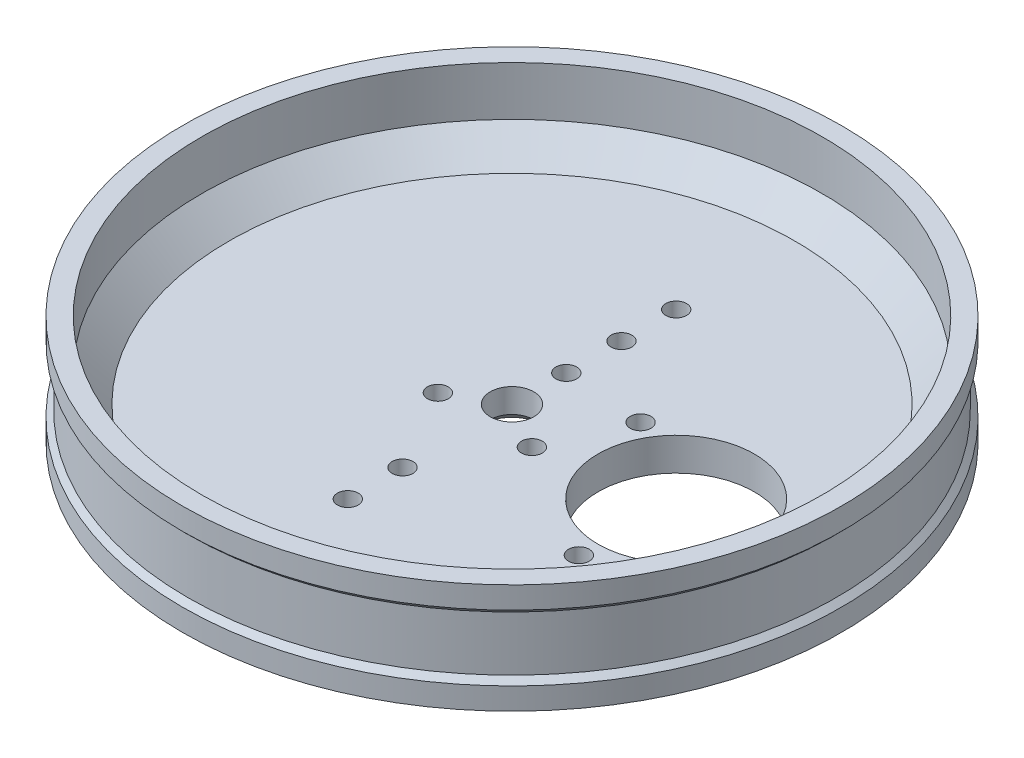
ISO-10303-21;
HEADER;
FILE_DESCRIPTION(('STEP AP214'),'2;1');
FILE_NAME('part.step','',(''),(''),'','','');
FILE_SCHEMA(('AUTOMOTIVE_DESIGN { 1 0 10303 214 1 1 1 1 }'));
ENDSEC;
DATA;
#1=APPLICATION_CONTEXT('core data for automotive mechanical design processes');
#2=APPLICATION_PROTOCOL_DEFINITION('international standard','automotive_design',2000,#1);
#3=PRODUCT_CONTEXT('',#1,'mechanical');
#4=PRODUCT('Part','Part','',(#3));
#5=PRODUCT_RELATED_PRODUCT_CATEGORY('part','',(#4));
#6=PRODUCT_DEFINITION_FORMATION('','',#4);
#7=PRODUCT_DEFINITION_CONTEXT('part definition',#1,'design');
#8=PRODUCT_DEFINITION('design','',#6,#7);
#9=PRODUCT_DEFINITION_SHAPE('','',#8);
#10=(LENGTH_UNIT() NAMED_UNIT(*) SI_UNIT(.MILLI.,.METRE.));
#11=(NAMED_UNIT(*) PLANE_ANGLE_UNIT() SI_UNIT($,.RADIAN.));
#12=(NAMED_UNIT(*) SI_UNIT($,.STERADIAN.) SOLID_ANGLE_UNIT());
#13=UNCERTAINTY_MEASURE_WITH_UNIT(LENGTH_MEASURE(1.E-05),#10,'distance_accuracy_value','');
#14=(GEOMETRIC_REPRESENTATION_CONTEXT(3) GLOBAL_UNCERTAINTY_ASSIGNED_CONTEXT((#13)) GLOBAL_UNIT_ASSIGNED_CONTEXT((#10,
#11,#12)) REPRESENTATION_CONTEXT('',''));
#15=CARTESIAN_POINT('',(0.,0.,0.));
#16=DIRECTION('',(0.,0.,1.));
#17=DIRECTION('',(1.,0.,0.));
#18=AXIS2_PLACEMENT_3D('',#15,#16,#17);
#19=CARTESIAN_POINT('',(0.,20.,0.));
#20=DIRECTION('',(0.,-1.,0.));
#21=DIRECTION('',(0.,0.,-1.));
#22=AXIS2_PLACEMENT_3D('',#19,#20,#21);
#23=CYLINDRICAL_SURFACE('',#22,60.225);
#24=CARTESIAN_POINT('',(0.,16.,0.));
#25=DIRECTION('',(0.,1.,0.));
#26=DIRECTION('',(0.,0.,1.));
#27=AXIS2_PLACEMENT_3D('',#24,#25,#26);
#28=CIRCLE('',#27,60.225);
#29=CARTESIAN_POINT('',(0.,16.,60.225));
#30=VERTEX_POINT('',#29);
#31=EDGE_CURVE('E82',#30,#30,#28,.T.);
#32=ORIENTED_EDGE('',*,*,#31,.T.);
#33=EDGE_LOOP('',(#32));
#34=FACE_BOUND('',#33,.T.);
#35=CARTESIAN_POINT('',(0.,20.,0.));
#36=DIRECTION('',(0.,1.,0.));
#37=DIRECTION('',(0.,0.,1.));
#38=AXIS2_PLACEMENT_3D('',#35,#36,#37);
#39=CIRCLE('',#38,60.225);
#40=CARTESIAN_POINT('',(0.,20.,60.225));
#41=VERTEX_POINT('',#40);
#42=EDGE_CURVE('E52',#41,#41,#39,.T.);
#43=ORIENTED_EDGE('',*,*,#42,.F.);
#44=EDGE_LOOP('',(#43));
#45=FACE_BOUND('',#44,.T.);
#46=ADVANCED_FACE('F32',(#34,#45),#23,.T.);
#47=CARTESIAN_POINT('',(0.,20.,0.));
#48=DIRECTION('',(0.,-1.,0.));
#49=DIRECTION('',(0.,0.,-1.));
#50=AXIS2_PLACEMENT_3D('',#47,#48,#49);
#51=CYLINDRICAL_SURFACE('',#50,3.96875);
#52=CARTESIAN_POINT('',(0.,1.58750000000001,0.));
#53=DIRECTION('',(0.,1.,0.));
#54=DIRECTION('',(0.,0.,1.));
#55=AXIS2_PLACEMENT_3D('',#52,#53,#54);
#56=CIRCLE('',#55,3.96875);
#57=CARTESIAN_POINT('',(0.,1.58750000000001,3.96875));
#58=VERTEX_POINT('',#57);
#59=EDGE_CURVE('E10',#58,#58,#56,.F.);
#60=ORIENTED_EDGE('',*,*,#59,.T.);
#61=EDGE_LOOP('',(#60));
#62=FACE_BOUND('',#61,.T.);
#63=CARTESIAN_POINT('',(0.,6.,0.));
#64=DIRECTION('',(0.,1.,0.));
#65=DIRECTION('',(0.,0.,1.));
#66=AXIS2_PLACEMENT_3D('',#63,#64,#65);
#67=CIRCLE('',#66,3.96875);
#68=CARTESIAN_POINT('',(0.,6.,3.96875));
#69=VERTEX_POINT('',#68);
#70=EDGE_CURVE('E53',#69,#69,#67,.T.);
#71=ORIENTED_EDGE('',*,*,#70,.T.);
#72=EDGE_LOOP('',(#71));
#73=FACE_BOUND('',#72,.T.);
#74=ADVANCED_FACE('F175',(#62,#73),#51,.F.);
#75=CARTESIAN_POINT('',(0.,20.,0.));
#76=DIRECTION('',(0.,1.,0.));
#77=DIRECTION('',(0.,0.,1.));
#78=AXIS2_PLACEMENT_3D('',#75,#76,#77);
#79=PLANE('',#78);
#80=CARTESIAN_POINT('',(0.,20.,0.));
#81=DIRECTION('',(0.,1.,0.));
#82=DIRECTION('',(0.,0.,1.));
#83=AXIS2_PLACEMENT_3D('',#80,#81,#82);
#84=CIRCLE('',#83,56.7);
#85=CARTESIAN_POINT('',(0.,20.,56.7));
#86=VERTEX_POINT('',#85);
#87=EDGE_CURVE('E57',#86,#86,#84,.T.);
#88=ORIENTED_EDGE('',*,*,#87,.F.);
#89=EDGE_LOOP('',(#88));
#90=FACE_BOUND('',#89,.T.);
#91=ORIENTED_EDGE('',*,*,#42,.T.);
#92=EDGE_LOOP('',(#91));
#93=FACE_BOUND('',#92,.T.);
#94=ADVANCED_FACE('F177',(#90,#93),#79,.T.);
#95=CARTESIAN_POINT('',(0.,0.,0.));
#96=DIRECTION('',(0.,1.,0.));
#97=DIRECTION('',(0.,0.,1.));
#98=AXIS2_PLACEMENT_3D('',#95,#96,#97);
#99=PLANE('',#98);
#100=CARTESIAN_POINT('',(14.6020683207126,0.,-8.88999999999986));
#101=DIRECTION('',(0.,1.,0.));
#102=DIRECTION('',(0.,0.,1.));
#103=AXIS2_PLACEMENT_3D('',#100,#101,#102);
#104=CIRCLE('',#103,1.89865);
#105=CARTESIAN_POINT('',(14.6020683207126,0.,-6.99134999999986));
#106=VERTEX_POINT('',#105);
#107=EDGE_CURVE('E136',#106,#106,#104,.T.);
#108=ORIENTED_EDGE('',*,*,#107,.T.);
#109=EDGE_LOOP('',(#108));
#110=FACE_BOUND('',#109,.T.);
#111=CARTESIAN_POINT('',(45.3979316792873,0.,-8.89000000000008));
#112=DIRECTION('',(0.,1.,0.));
#113=DIRECTION('',(0.,0.,1.));
#114=AXIS2_PLACEMENT_3D('',#111,#112,#113);
#115=CIRCLE('',#114,1.89864999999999);
#116=CARTESIAN_POINT('',(45.3979316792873,0.,-6.99135000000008));
#117=VERTEX_POINT('',#116);
#118=EDGE_CURVE('E130',#117,#117,#115,.T.);
#119=ORIENTED_EDGE('',*,*,#118,.T.);
#120=EDGE_LOOP('',(#119));
#121=FACE_BOUND('',#120,.T.);
#122=CARTESIAN_POINT('',(30.,0.,17.78));
#123=DIRECTION('',(0.,1.,0.));
#124=DIRECTION('',(0.,0.,1.));
#125=AXIS2_PLACEMENT_3D('',#122,#123,#124);
#126=CIRCLE('',#125,1.89865);
#127=CARTESIAN_POINT('',(30.,0.,19.67865));
#128=VERTEX_POINT('',#127);
#129=EDGE_CURVE('E124',#128,#128,#126,.T.);
#130=ORIENTED_EDGE('',*,*,#129,.T.);
#131=EDGE_LOOP('',(#130));
#132=FACE_BOUND('',#131,.T.);
#133=CARTESIAN_POINT('',(0.,0.,-30.));
#134=DIRECTION('',(0.,1.,0.));
#135=DIRECTION('',(0.,0.,1.));
#136=AXIS2_PLACEMENT_3D('',#133,#134,#135);
#137=CIRCLE('',#136,1.89865);
#138=CARTESIAN_POINT('',(0.,0.,-28.10135));
#139=VERTEX_POINT('',#138);
#140=EDGE_CURVE('E118',#139,#139,#137,.T.);
#141=ORIENTED_EDGE('',*,*,#140,.T.);
#142=EDGE_LOOP('',(#141));
#143=FACE_BOUND('',#142,.T.);
#144=CARTESIAN_POINT('',(0.,0.,-20.));
#145=DIRECTION('',(0.,1.,0.));
#146=DIRECTION('',(0.,0.,1.));
#147=AXIS2_PLACEMENT_3D('',#144,#145,#146);
#148=CIRCLE('',#147,1.89865);
#149=CARTESIAN_POINT('',(0.,0.,-18.10135));
#150=VERTEX_POINT('',#149);
#151=EDGE_CURVE('E112',#150,#150,#148,.T.);
#152=ORIENTED_EDGE('',*,*,#151,.T.);
#153=EDGE_LOOP('',(#152));
#154=FACE_BOUND('',#153,.T.);
#155=CARTESIAN_POINT('',(0.,0.,30.));
#156=DIRECTION('',(0.,1.,0.));
#157=DIRECTION('',(0.,0.,1.));
#158=AXIS2_PLACEMENT_3D('',#155,#156,#157);
#159=CIRCLE('',#158,1.89865);
#160=CARTESIAN_POINT('',(0.,0.,31.89865));
#161=VERTEX_POINT('',#160);
#162=EDGE_CURVE('E106',#161,#161,#159,.T.);
#163=ORIENTED_EDGE('',*,*,#162,.T.);
#164=EDGE_LOOP('',(#163));
#165=FACE_BOUND('',#164,.T.);
#166=CARTESIAN_POINT('',(0.,0.,20.));
#167=DIRECTION('',(0.,1.,0.));
#168=DIRECTION('',(0.,0.,1.));
#169=AXIS2_PLACEMENT_3D('',#166,#167,#168);
#170=CIRCLE('',#169,1.89865);
#171=CARTESIAN_POINT('',(0.,0.,21.89865));
#172=VERTEX_POINT('',#171);
#173=EDGE_CURVE('E100',#172,#172,#170,.T.);
#174=ORIENTED_EDGE('',*,*,#173,.T.);
#175=EDGE_LOOP('',(#174));
#176=FACE_BOUND('',#175,.T.);
#177=CARTESIAN_POINT('',(30.,0.,0.));
#178=DIRECTION('',(0.,1.,0.));
#179=DIRECTION('',(0.,0.,1.));
#180=AXIS2_PLACEMENT_3D('',#177,#178,#179);
#181=CIRCLE('',#180,14.2875);
#182=CARTESIAN_POINT('',(30.,0.,14.2875));
#183=VERTEX_POINT('',#182);
#184=EDGE_CURVE('E94',#183,#183,#181,.T.);
#185=ORIENTED_EDGE('',*,*,#184,.T.);
#186=EDGE_LOOP('',(#185));
#187=FACE_BOUND('',#186,.T.);
#188=CARTESIAN_POINT('',(0.,0.,0.));
#189=DIRECTION('',(0.,1.,0.));
#190=DIRECTION('',(0.,0.,1.));
#191=AXIS2_PLACEMENT_3D('',#188,#189,#190);
#192=CIRCLE('',#191,5.55625);
#193=CARTESIAN_POINT('',(0.,0.,5.55625));
#194=VERTEX_POINT('',#193);
#195=EDGE_CURVE('E39',#194,#194,#192,.T.);
#196=ORIENTED_EDGE('',*,*,#195,.T.);
#197=EDGE_LOOP('',(#196));
#198=FACE_BOUND('',#197,.T.);
#199=CARTESIAN_POINT('',(8.59259580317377,0.,4.96093749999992));
#200=DIRECTION('',(0.,1.,0.));
#201=DIRECTION('',(0.,0.,1.));
#202=AXIS2_PLACEMENT_3D('',#199,#200,#201);
#203=CIRCLE('',#202,1.89865);
#204=CARTESIAN_POINT('',(8.59259580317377,0.,6.85958749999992));
#205=VERTEX_POINT('',#204);
#206=EDGE_CURVE('E76',#205,#205,#203,.T.);
#207=ORIENTED_EDGE('',*,*,#206,.T.);
#208=EDGE_LOOP('',(#207));
#209=FACE_BOUND('',#208,.T.);
#210=CARTESIAN_POINT('',(-8.59259580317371,0.,4.96093750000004));
#211=DIRECTION('',(0.,1.,0.));
#212=DIRECTION('',(0.,0.,1.));
#213=AXIS2_PLACEMENT_3D('',#210,#211,#212);
#214=CIRCLE('',#213,1.89865);
#215=CARTESIAN_POINT('',(-8.59259580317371,0.,6.85958750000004));
#216=VERTEX_POINT('',#215);
#217=EDGE_CURVE('E70',#216,#216,#214,.T.);
#218=ORIENTED_EDGE('',*,*,#217,.T.);
#219=EDGE_LOOP('',(#218));
#220=FACE_BOUND('',#219,.T.);
#221=CARTESIAN_POINT('',(0.,0.,-9.921875));
#222=DIRECTION('',(0.,1.,0.));
#223=DIRECTION('',(0.,0.,1.));
#224=AXIS2_PLACEMENT_3D('',#221,#222,#223);
#225=CIRCLE('',#224,1.89865);
#226=CARTESIAN_POINT('',(0.,0.,-8.023225));
#227=VERTEX_POINT('',#226);
#228=EDGE_CURVE('E64',#227,#227,#225,.T.);
#229=ORIENTED_EDGE('',*,*,#228,.T.);
#230=EDGE_LOOP('',(#229));
#231=FACE_BOUND('',#230,.T.);
#232=CARTESIAN_POINT('',(0.,0.,0.));
#233=DIRECTION('',(0.,1.,0.));
#234=DIRECTION('',(0.,0.,1.));
#235=AXIS2_PLACEMENT_3D('',#232,#233,#234);
#236=CIRCLE('',#235,60.225);
#237=CARTESIAN_POINT('',(0.,0.,60.225));
#238=VERTEX_POINT('',#237);
#239=EDGE_CURVE('E56',#238,#238,#236,.T.);
#240=ORIENTED_EDGE('',*,*,#239,.F.);
#241=EDGE_LOOP('',(#240));
#242=FACE_BOUND('',#241,.T.);
#243=ADVANCED_FACE('F183',(#110,#121,#132,#143,#154,#165,#176,#187,#198,#209,#220,#231,#242),
#99,.F.);
#244=CARTESIAN_POINT('',(0.,4.00000000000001,0.));
#245=DIRECTION('',(0.,1.,0.));
#246=DIRECTION('',(0.,0.,1.));
#247=AXIS2_PLACEMENT_3D('',#244,#245,#246);
#248=CIRCLE('',#247,60.225);
#249=CARTESIAN_POINT('',(0.,4.00000000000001,60.225));
#250=VERTEX_POINT('',#249);
#251=EDGE_CURVE('E91',#250,#250,#248,.T.);
#252=ORIENTED_EDGE('',*,*,#251,.F.);
#253=EDGE_LOOP('',(#252));
#254=FACE_BOUND('',#253,.T.);
#255=ORIENTED_EDGE('',*,*,#239,.T.);
#256=EDGE_LOOP('',(#255));
#257=FACE_BOUND('',#256,.T.);
#258=ADVANCED_FACE('F188',(#254,#257),#23,.T.);
#259=CARTESIAN_POINT('',(0.,6.,0.));
#260=DIRECTION('',(0.,1.,0.));
#261=DIRECTION('',(0.,0.,1.));
#262=AXIS2_PLACEMENT_3D('',#259,#260,#261);
#263=CYLINDRICAL_SURFACE('',#262,56.7);
#264=CARTESIAN_POINT('',(0.,10.9999999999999,0.));
#265=DIRECTION('',(0.,1.,0.));
#266=DIRECTION('',(0.,0.,1.));
#267=AXIS2_PLACEMENT_3D('',#264,#265,#266);
#268=CIRCLE('',#267,56.7);
#269=CARTESIAN_POINT('',(0.,10.9999999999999,56.7));
#270=VERTEX_POINT('',#269);
#271=EDGE_CURVE('E43',#270,#270,#268,.F.);
#272=CARTESIAN_POINT('',(0.,10.9999999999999,56.7));
#273=CARTESIAN_POINT('',(0.,11.0937499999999,56.7));
#274=CARTESIAN_POINT('',(0.,11.1874999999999,56.7));
#275=CARTESIAN_POINT('',(0.,11.3749999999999,56.7));
#276=CARTESIAN_POINT('',(0.,11.4687499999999,56.7));
#277=CARTESIAN_POINT('',(0.,11.6562499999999,56.7));
#278=CARTESIAN_POINT('',(0.,11.7499999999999,56.7));
#279=CARTESIAN_POINT('',(0.,11.9374999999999,56.7));
#280=CARTESIAN_POINT('',(0.,12.0312499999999,56.7));
#281=CARTESIAN_POINT('',(0.,12.2187499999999,56.7));
#282=CARTESIAN_POINT('',(0.,12.3124999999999,56.7));
#283=CARTESIAN_POINT('',(0.,12.4999999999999,56.7));
#284=CARTESIAN_POINT('',(0.,12.5937499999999,56.7));
#285=CARTESIAN_POINT('',(0.,12.7812499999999,56.7));
#286=CARTESIAN_POINT('',(0.,12.8749999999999,56.7));
#287=CARTESIAN_POINT('',(0.,13.0624999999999,56.7));
#288=CARTESIAN_POINT('',(0.,13.1562499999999,56.7));
#289=CARTESIAN_POINT('',(0.,13.3437499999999,56.7));
#290=CARTESIAN_POINT('',(0.,13.4374999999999,56.7));
#291=CARTESIAN_POINT('',(0.,13.6249999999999,56.7));
#292=CARTESIAN_POINT('',(0.,13.7187499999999,56.7));
#293=CARTESIAN_POINT('',(0.,13.9062499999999,56.7));
#294=CARTESIAN_POINT('',(0.,13.9999999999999,56.7));
#295=CARTESIAN_POINT('',(0.,14.1874999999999,56.7));
#296=CARTESIAN_POINT('',(0.,14.2812499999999,56.7));
#297=CARTESIAN_POINT('',(0.,14.4687499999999,56.7));
#298=CARTESIAN_POINT('',(0.,14.5624999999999,56.7));
#299=CARTESIAN_POINT('',(0.,14.7499999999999,56.7));
#300=CARTESIAN_POINT('',(0.,14.8437499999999,56.7));
#301=CARTESIAN_POINT('',(0.,15.0312499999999,56.7));
#302=CARTESIAN_POINT('',(0.,15.1249999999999,56.7));
#303=CARTESIAN_POINT('',(0.,15.3124999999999,56.7));
#304=CARTESIAN_POINT('',(0.,15.4062499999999,56.7));
#305=CARTESIAN_POINT('',(0.,15.5937499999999,56.7));
#306=CARTESIAN_POINT('',(0.,15.6874999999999,56.7));
#307=CARTESIAN_POINT('',(0.,15.8749999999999,56.7));
#308=CARTESIAN_POINT('',(0.,15.9687499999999,56.7));
#309=CARTESIAN_POINT('',(0.,16.1562499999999,56.7));
#310=CARTESIAN_POINT('',(0.,16.25,56.7));
#311=CARTESIAN_POINT('',(0.,16.4375,56.7));
#312=CARTESIAN_POINT('',(0.,16.53125,56.7));
#313=CARTESIAN_POINT('',(0.,16.71875,56.7));
#314=CARTESIAN_POINT('',(0.,16.8125,56.7));
#315=CARTESIAN_POINT('',(0.,17.,56.7));
#316=CARTESIAN_POINT('',(0.,17.09375,56.7));
#317=CARTESIAN_POINT('',(0.,17.28125,56.7));
#318=CARTESIAN_POINT('',(0.,17.375,56.7));
#319=CARTESIAN_POINT('',(0.,17.5625,56.7));
#320=CARTESIAN_POINT('',(0.,17.65625,56.7));
#321=CARTESIAN_POINT('',(0.,17.84375,56.7));
#322=CARTESIAN_POINT('',(0.,17.9375,56.7));
#323=CARTESIAN_POINT('',(0.,18.125,56.7));
#324=CARTESIAN_POINT('',(0.,18.21875,56.7));
#325=CARTESIAN_POINT('',(0.,18.40625,56.7));
#326=CARTESIAN_POINT('',(0.,18.5,56.7));
#327=CARTESIAN_POINT('',(0.,18.6875,56.7));
#328=CARTESIAN_POINT('',(0.,18.78125,56.7));
#329=CARTESIAN_POINT('',(0.,18.96875,56.7));
#330=CARTESIAN_POINT('',(0.,19.0625,56.7));
#331=CARTESIAN_POINT('',(0.,19.25,56.7));
#332=CARTESIAN_POINT('',(0.,19.34375,56.7));
#333=CARTESIAN_POINT('',(0.,19.53125,56.7));
#334=CARTESIAN_POINT('',(0.,19.625,56.7));
#335=CARTESIAN_POINT('',(0.,19.8125,56.7));
#336=CARTESIAN_POINT('',(0.,19.90625,56.7));
#337=CARTESIAN_POINT('',(0.,20.,56.7));
#338=B_SPLINE_CURVE_WITH_KNOTS('',3,(#272,#273,#274,#275,#276,#277,#278,#279,#280,#281,#282,
#283,#284,#285,#286,#287,#288,#289,#290,#291,#292,#293,#294,#295,#296,#297,#298,#299,#300,#301,
#302,#303,#304,#305,#306,#307,#308,#309,#310,#311,#312,#313,#314,#315,#316,#317,#318,#319,#320,
#321,#322,#323,#324,#325,#326,#327,#328,#329,#330,#331,#332,#333,#334,#335,#336,#337),
.UNSPECIFIED.,.F.,.F.,(4,2,2,2,2,2,2,2,2,2,2,2,2,2,2,2,2,2,2,2,2,2,2,2,2,2,2,2,2,2,2,2,4),(0.,
0.281250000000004,0.562500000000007,0.843750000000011,1.12500000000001,1.40625000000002,
1.68750000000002,1.96875000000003,2.25000000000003,2.53125000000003,2.81250000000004,
3.09375000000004,3.37500000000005,3.65625000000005,3.93750000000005,4.21875000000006,
4.50000000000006,4.78125000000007,5.06250000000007,5.34375000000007,5.62500000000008,
5.90625000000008,6.18750000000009,6.46875000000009,6.75000000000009,7.0312500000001,
7.3125000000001,7.5937500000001,7.87500000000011,8.15625000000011,8.43750000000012,
8.71875000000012,9.00000000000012),.UNSPECIFIED.);
#339=EDGE_CURVE('BSEAM149',#270,#86,#338,.T.);
#340=ORIENTED_EDGE('',*,*,#271,.T.);
#341=ORIENTED_EDGE('',*,*,#87,.T.);
#342=ORIENTED_EDGE('',*,*,#339,.T.);
#343=ORIENTED_EDGE('',*,*,#339,.F.);
#344=EDGE_LOOP('',(#340,#342,#341,#343));
#345=FACE_BOUND('',#344,.T.);
#346=ADVANCED_FACE('F149',(#345),#263,.F.);
#347=CARTESIAN_POINT('',(0.,6.,0.));
#348=DIRECTION('',(0.,1.,0.));
#349=DIRECTION('',(0.,0.,1.));
#350=AXIS2_PLACEMENT_3D('',#347,#348,#349);
#351=PLANE('',#350);
#352=CARTESIAN_POINT('',(14.6020683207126,6.,-8.88999999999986));
#353=DIRECTION('',(0.,1.,0.));
#354=DIRECTION('',(0.,0.,1.));
#355=AXIS2_PLACEMENT_3D('',#352,#353,#354);
#356=CIRCLE('',#355,1.89864999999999);
#357=CARTESIAN_POINT('',(14.6020683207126,6.,-6.99134999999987));
#358=VERTEX_POINT('',#357);
#359=EDGE_CURVE('E139',#358,#358,#356,.T.);
#360=ORIENTED_EDGE('',*,*,#359,.F.);
#361=EDGE_LOOP('',(#360));
#362=FACE_BOUND('',#361,.T.);
#363=CARTESIAN_POINT('',(45.3979316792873,6.,-8.89000000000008));
#364=DIRECTION('',(0.,1.,0.));
#365=DIRECTION('',(0.,0.,1.));
#366=AXIS2_PLACEMENT_3D('',#363,#364,#365);
#367=CIRCLE('',#366,1.89864999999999);
#368=CARTESIAN_POINT('',(45.3979316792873,6.,-6.99135000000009));
#369=VERTEX_POINT('',#368);
#370=EDGE_CURVE('E133',#369,#369,#367,.T.);
#371=ORIENTED_EDGE('',*,*,#370,.F.);
#372=EDGE_LOOP('',(#371));
#373=FACE_BOUND('',#372,.T.);
#374=CARTESIAN_POINT('',(30.,6.,17.78));
#375=DIRECTION('',(0.,1.,0.));
#376=DIRECTION('',(0.,0.,1.));
#377=AXIS2_PLACEMENT_3D('',#374,#375,#376);
#378=CIRCLE('',#377,1.89864999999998);
#379=CARTESIAN_POINT('',(30.,6.,19.67865));
#380=VERTEX_POINT('',#379);
#381=EDGE_CURVE('E127',#380,#380,#378,.T.);
#382=ORIENTED_EDGE('',*,*,#381,.F.);
#383=EDGE_LOOP('',(#382));
#384=FACE_BOUND('',#383,.T.);
#385=CARTESIAN_POINT('',(0.,6.,-30.));
#386=DIRECTION('',(0.,1.,0.));
#387=DIRECTION('',(0.,0.,1.));
#388=AXIS2_PLACEMENT_3D('',#385,#386,#387);
#389=CIRCLE('',#388,1.89865);
#390=CARTESIAN_POINT('',(0.,6.,-28.10135));
#391=VERTEX_POINT('',#390);
#392=EDGE_CURVE('E121',#391,#391,#389,.T.);
#393=ORIENTED_EDGE('',*,*,#392,.F.);
#394=EDGE_LOOP('',(#393));
#395=FACE_BOUND('',#394,.T.);
#396=CARTESIAN_POINT('',(0.,6.,-20.));
#397=DIRECTION('',(0.,1.,0.));
#398=DIRECTION('',(0.,0.,1.));
#399=AXIS2_PLACEMENT_3D('',#396,#397,#398);
#400=CIRCLE('',#399,1.89865);
#401=CARTESIAN_POINT('',(0.,6.,-18.10135));
#402=VERTEX_POINT('',#401);
#403=EDGE_CURVE('E115',#402,#402,#400,.T.);
#404=ORIENTED_EDGE('',*,*,#403,.F.);
#405=EDGE_LOOP('',(#404));
#406=FACE_BOUND('',#405,.T.);
#407=CARTESIAN_POINT('',(0.,6.,30.));
#408=DIRECTION('',(0.,1.,0.));
#409=DIRECTION('',(0.,0.,1.));
#410=AXIS2_PLACEMENT_3D('',#407,#408,#409);
#411=CIRCLE('',#410,1.89865);
#412=CARTESIAN_POINT('',(0.,6.,31.89865));
#413=VERTEX_POINT('',#412);
#414=EDGE_CURVE('E109',#413,#413,#411,.T.);
#415=ORIENTED_EDGE('',*,*,#414,.F.);
#416=EDGE_LOOP('',(#415));
#417=FACE_BOUND('',#416,.T.);
#418=CARTESIAN_POINT('',(0.,6.,20.));
#419=DIRECTION('',(0.,1.,0.));
#420=DIRECTION('',(0.,0.,1.));
#421=AXIS2_PLACEMENT_3D('',#418,#419,#420);
#422=CIRCLE('',#421,1.89865);
#423=CARTESIAN_POINT('',(0.,6.,21.89865));
#424=VERTEX_POINT('',#423);
#425=EDGE_CURVE('E103',#424,#424,#422,.T.);
#426=ORIENTED_EDGE('',*,*,#425,.F.);
#427=EDGE_LOOP('',(#426));
#428=FACE_BOUND('',#427,.T.);
#429=CARTESIAN_POINT('',(30.,6.,0.));
#430=DIRECTION('',(0.,1.,0.));
#431=DIRECTION('',(0.,0.,1.));
#432=AXIS2_PLACEMENT_3D('',#429,#430,#431);
#433=CIRCLE('',#432,14.2875);
#434=CARTESIAN_POINT('',(30.,6.,14.2875));
#435=VERTEX_POINT('',#434);
#436=EDGE_CURVE('E97',#435,#435,#433,.T.);
#437=ORIENTED_EDGE('',*,*,#436,.F.);
#438=EDGE_LOOP('',(#437));
#439=FACE_BOUND('',#438,.T.);
#440=CARTESIAN_POINT('',(8.59259580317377,6.,4.96093749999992));
#441=DIRECTION('',(0.,1.,0.));
#442=DIRECTION('',(0.,0.,1.));
#443=AXIS2_PLACEMENT_3D('',#440,#441,#442);
#444=CIRCLE('',#443,1.89865);
#445=CARTESIAN_POINT('',(8.59259580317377,6.,6.85958749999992));
#446=VERTEX_POINT('',#445);
#447=EDGE_CURVE('E79',#446,#446,#444,.T.);
#448=ORIENTED_EDGE('',*,*,#447,.F.);
#449=EDGE_LOOP('',(#448));
#450=FACE_BOUND('',#449,.T.);
#451=CARTESIAN_POINT('',(-8.59259580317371,6.,4.96093750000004));
#452=DIRECTION('',(0.,1.,0.));
#453=DIRECTION('',(0.,0.,1.));
#454=AXIS2_PLACEMENT_3D('',#451,#452,#453);
#455=CIRCLE('',#454,1.89865);
#456=CARTESIAN_POINT('',(-8.59259580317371,6.,6.85958750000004));
#457=VERTEX_POINT('',#456);
#458=EDGE_CURVE('E73',#457,#457,#455,.T.);
#459=ORIENTED_EDGE('',*,*,#458,.F.);
#460=EDGE_LOOP('',(#459));
#461=FACE_BOUND('',#460,.T.);
#462=CARTESIAN_POINT('',(0.,6.,-9.921875));
#463=DIRECTION('',(0.,1.,0.));
#464=DIRECTION('',(0.,0.,1.));
#465=AXIS2_PLACEMENT_3D('',#462,#463,#464);
#466=CIRCLE('',#465,1.89865);
#467=CARTESIAN_POINT('',(0.,6.,-8.023225));
#468=VERTEX_POINT('',#467);
#469=EDGE_CURVE('E67',#468,#468,#466,.T.);
#470=ORIENTED_EDGE('',*,*,#469,.F.);
#471=EDGE_LOOP('',(#470));
#472=FACE_BOUND('',#471,.T.);
#473=CARTESIAN_POINT('',(0.,6.,0.));
#474=DIRECTION('',(0.,1.,0.));
#475=DIRECTION('',(0.,0.,1.));
#476=AXIS2_PLACEMENT_3D('',#473,#474,#475);
#477=CIRCLE('',#476,51.7000000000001);
#478=CARTESIAN_POINT('',(0.,6.,51.7000000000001));
#479=VERTEX_POINT('',#478);
#480=EDGE_CURVE('E47',#479,#479,#477,.T.);
#481=ORIENTED_EDGE('',*,*,#480,.T.);
#482=EDGE_LOOP('',(#481));
#483=FACE_BOUND('',#482,.T.);
#484=ORIENTED_EDGE('',*,*,#70,.F.);
#485=EDGE_LOOP('',(#484));
#486=FACE_BOUND('',#485,.T.);
#487=ADVANCED_FACE('F145',(#362,#373,#384,#395,#406,#417,#428,#439,#450,#461,#472,#483,#486),
#351,.T.);
#488=CARTESIAN_POINT('',(0.,6.,0.));
#489=DIRECTION('',(0.,1.,0.));
#490=DIRECTION('',(0.,0.,1.));
#491=AXIS2_PLACEMENT_3D('',#488,#489,#490);
#492=CONICAL_SURFACE('',#491,51.7000000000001,0.785398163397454);
#493=ORIENTED_EDGE('',*,*,#271,.F.);
#494=EDGE_LOOP('',(#493));
#495=FACE_BOUND('',#494,.T.);
#496=ORIENTED_EDGE('',*,*,#480,.F.);
#497=EDGE_LOOP('',(#496));
#498=FACE_BOUND('',#497,.T.);
#499=ADVANCED_FACE('F148',(#495,#498),#492,.F.);
#500=CARTESIAN_POINT('',(0.,6.,-9.921875));
#501=DIRECTION('',(0.,1.,0.));
#502=DIRECTION('',(0.,0.,1.));
#503=AXIS2_PLACEMENT_3D('',#500,#501,#502);
#504=CYLINDRICAL_SURFACE('',#503,1.89865);
#505=ORIENTED_EDGE('',*,*,#228,.F.);
#506=EDGE_LOOP('',(#505));
#507=FACE_BOUND('',#506,.T.);
#508=ORIENTED_EDGE('',*,*,#469,.T.);
#509=EDGE_LOOP('',(#508));
#510=FACE_BOUND('',#509,.T.);
#511=ADVANCED_FACE('F196',(#507,#510),#504,.F.);
#512=CARTESIAN_POINT('',(-8.59259580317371,6.,4.96093750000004));
#513=DIRECTION('',(0.,1.,0.));
#514=DIRECTION('',(0.,0.,1.));
#515=AXIS2_PLACEMENT_3D('',#512,#513,#514);
#516=CYLINDRICAL_SURFACE('',#515,1.89865);
#517=ORIENTED_EDGE('',*,*,#217,.F.);
#518=EDGE_LOOP('',(#517));
#519=FACE_BOUND('',#518,.T.);
#520=ORIENTED_EDGE('',*,*,#458,.T.);
#521=EDGE_LOOP('',(#520));
#522=FACE_BOUND('',#521,.T.);
#523=ADVANCED_FACE('F202',(#519,#522),#516,.F.);
#524=CARTESIAN_POINT('',(8.59259580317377,6.,4.96093749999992));
#525=DIRECTION('',(0.,1.,0.));
#526=DIRECTION('',(0.,0.,1.));
#527=AXIS2_PLACEMENT_3D('',#524,#525,#526);
#528=CYLINDRICAL_SURFACE('',#527,1.89865);
#529=ORIENTED_EDGE('',*,*,#206,.F.);
#530=EDGE_LOOP('',(#529));
#531=FACE_BOUND('',#530,.T.);
#532=ORIENTED_EDGE('',*,*,#447,.T.);
#533=EDGE_LOOP('',(#532));
#534=FACE_BOUND('',#533,.T.);
#535=ADVANCED_FACE('F288',(#531,#534),#528,.F.);
#536=CARTESIAN_POINT('',(0.,0.,0.));
#537=DIRECTION('',(0.,-1.,0.));
#538=DIRECTION('',(0.,0.,-1.));
#539=AXIS2_PLACEMENT_3D('',#536,#537,#538);
#540=CONICAL_SURFACE('',#539,5.55625,0.785398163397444);
#541=ORIENTED_EDGE('',*,*,#59,.F.);
#542=EDGE_LOOP('',(#541));
#543=FACE_BOUND('',#542,.T.);
#544=ORIENTED_EDGE('',*,*,#195,.F.);
#545=EDGE_LOOP('',(#544));
#546=FACE_BOUND('',#545,.T.);
#547=ADVANCED_FACE('F34',(#543,#546),#540,.F.);
#548=CARTESIAN_POINT('',(0.,15.,0.));
#549=DIRECTION('',(0.,1.,0.));
#550=DIRECTION('',(0.,0.,1.));
#551=AXIS2_PLACEMENT_3D('',#548,#549,#550);
#552=CONICAL_SURFACE('',#551,59.225,0.78539816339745);
#553=ORIENTED_EDGE('',*,*,#31,.F.);
#554=EDGE_LOOP('',(#553));
#555=FACE_BOUND('',#554,.T.);
#556=CARTESIAN_POINT('',(0.,15.,0.));
#557=DIRECTION('',(0.,1.,0.));
#558=DIRECTION('',(0.,0.,1.));
#559=AXIS2_PLACEMENT_3D('',#556,#557,#558);
#560=CIRCLE('',#559,59.225);
#561=CARTESIAN_POINT('',(0.,15.,59.225));
#562=VERTEX_POINT('',#561);
#563=EDGE_CURVE('E85',#562,#562,#560,.T.);
#564=ORIENTED_EDGE('',*,*,#563,.T.);
#565=EDGE_LOOP('',(#564));
#566=FACE_BOUND('',#565,.T.);
#567=ADVANCED_FACE('F283',(#555,#566),#552,.T.);
#568=CARTESIAN_POINT('',(0.,6.,0.));
#569=DIRECTION('',(0.,1.,0.));
#570=DIRECTION('',(0.,0.,1.));
#571=AXIS2_PLACEMENT_3D('',#568,#569,#570);
#572=CYLINDRICAL_SURFACE('',#571,59.225);
#573=ORIENTED_EDGE('',*,*,#563,.F.);
#574=EDGE_LOOP('',(#573));
#575=FACE_BOUND('',#574,.T.);
#576=CARTESIAN_POINT('',(0.,5.,0.));
#577=DIRECTION('',(0.,1.,0.));
#578=DIRECTION('',(0.,0.,1.));
#579=AXIS2_PLACEMENT_3D('',#576,#577,#578);
#580=CIRCLE('',#579,59.225);
#581=CARTESIAN_POINT('',(0.,5.,59.225));
#582=VERTEX_POINT('',#581);
#583=EDGE_CURVE('E88',#582,#582,#580,.T.);
#584=ORIENTED_EDGE('',*,*,#583,.T.);
#585=EDGE_LOOP('',(#584));
#586=FACE_BOUND('',#585,.T.);
#587=ADVANCED_FACE('F279',(#575,#586),#572,.T.);
#588=CARTESIAN_POINT('',(0.,4.00000000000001,0.));
#589=DIRECTION('',(0.,-1.,0.));
#590=DIRECTION('',(0.,0.,-1.));
#591=AXIS2_PLACEMENT_3D('',#588,#589,#590);
#592=CONICAL_SURFACE('',#591,60.225,0.785398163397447);
#593=ORIENTED_EDGE('',*,*,#583,.F.);
#594=EDGE_LOOP('',(#593));
#595=FACE_BOUND('',#594,.T.);
#596=ORIENTED_EDGE('',*,*,#251,.T.);
#597=EDGE_LOOP('',(#596));
#598=FACE_BOUND('',#597,.T.);
#599=ADVANCED_FACE('F275',(#595,#598),#592,.T.);
#600=CARTESIAN_POINT('',(30.,-4.,0.));
#601=DIRECTION('',(0.,1.,0.));
#602=DIRECTION('',(0.,0.,1.));
#603=AXIS2_PLACEMENT_3D('',#600,#601,#602);
#604=CYLINDRICAL_SURFACE('',#603,14.2875);
#605=ORIENTED_EDGE('',*,*,#436,.T.);
#606=EDGE_LOOP('',(#605));
#607=FACE_BOUND('',#606,.T.);
#608=ORIENTED_EDGE('',*,*,#184,.F.);
#609=EDGE_LOOP('',(#608));
#610=FACE_BOUND('',#609,.T.);
#611=ADVANCED_FACE('F271',(#607,#610),#604,.F.);
#612=CARTESIAN_POINT('',(0.,6.,20.));
#613=DIRECTION('',(0.,1.,0.));
#614=DIRECTION('',(0.,0.,1.));
#615=AXIS2_PLACEMENT_3D('',#612,#613,#614);
#616=CYLINDRICAL_SURFACE('',#615,1.89865);
#617=ORIENTED_EDGE('',*,*,#173,.F.);
#618=EDGE_LOOP('',(#617));
#619=FACE_BOUND('',#618,.T.);
#620=ORIENTED_EDGE('',*,*,#425,.T.);
#621=EDGE_LOOP('',(#620));
#622=FACE_BOUND('',#621,.T.);
#623=ADVANCED_FACE('F267',(#619,#622),#616,.F.);
#624=CARTESIAN_POINT('',(0.,6.,30.));
#625=DIRECTION('',(0.,1.,0.));
#626=DIRECTION('',(0.,0.,1.));
#627=AXIS2_PLACEMENT_3D('',#624,#625,#626);
#628=CYLINDRICAL_SURFACE('',#627,1.89865);
#629=ORIENTED_EDGE('',*,*,#162,.F.);
#630=EDGE_LOOP('',(#629));
#631=FACE_BOUND('',#630,.T.);
#632=ORIENTED_EDGE('',*,*,#414,.T.);
#633=EDGE_LOOP('',(#632));
#634=FACE_BOUND('',#633,.T.);
#635=ADVANCED_FACE('F263',(#631,#634),#628,.F.);
#636=CARTESIAN_POINT('',(0.,6.,-20.));
#637=DIRECTION('',(0.,1.,0.));
#638=DIRECTION('',(0.,0.,1.));
#639=AXIS2_PLACEMENT_3D('',#636,#637,#638);
#640=CYLINDRICAL_SURFACE('',#639,1.89865);
#641=ORIENTED_EDGE('',*,*,#151,.F.);
#642=EDGE_LOOP('',(#641));
#643=FACE_BOUND('',#642,.T.);
#644=ORIENTED_EDGE('',*,*,#403,.T.);
#645=EDGE_LOOP('',(#644));
#646=FACE_BOUND('',#645,.T.);
#647=ADVANCED_FACE('F259',(#643,#646),#640,.F.);
#648=CARTESIAN_POINT('',(0.,6.,-30.));
#649=DIRECTION('',(0.,1.,0.));
#650=DIRECTION('',(0.,0.,1.));
#651=AXIS2_PLACEMENT_3D('',#648,#649,#650);
#652=CYLINDRICAL_SURFACE('',#651,1.89865);
#653=ORIENTED_EDGE('',*,*,#140,.F.);
#654=EDGE_LOOP('',(#653));
#655=FACE_BOUND('',#654,.T.);
#656=ORIENTED_EDGE('',*,*,#392,.T.);
#657=EDGE_LOOP('',(#656));
#658=FACE_BOUND('',#657,.T.);
#659=ADVANCED_FACE('F255',(#655,#658),#652,.F.);
#660=CARTESIAN_POINT('',(30.,6.,17.78));
#661=DIRECTION('',(0.,1.,0.));
#662=DIRECTION('',(0.,0.,1.));
#663=AXIS2_PLACEMENT_3D('',#660,#661,#662);
#664=CYLINDRICAL_SURFACE('',#663,1.89864999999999);
#665=ORIENTED_EDGE('',*,*,#129,.F.);
#666=EDGE_LOOP('',(#665));
#667=FACE_BOUND('',#666,.T.);
#668=ORIENTED_EDGE('',*,*,#381,.T.);
#669=EDGE_LOOP('',(#668));
#670=FACE_BOUND('',#669,.T.);
#671=ADVANCED_FACE('F236',(#667,#670),#664,.F.);
#672=CARTESIAN_POINT('',(45.3979316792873,6.,-8.89000000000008));
#673=DIRECTION('',(0.,1.,0.));
#674=DIRECTION('',(0.,0.,1.));
#675=AXIS2_PLACEMENT_3D('',#672,#673,#674);
#676=CYLINDRICAL_SURFACE('',#675,1.89864999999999);
#677=ORIENTED_EDGE('',*,*,#118,.F.);
#678=EDGE_LOOP('',(#677));
#679=FACE_BOUND('',#678,.T.);
#680=ORIENTED_EDGE('',*,*,#370,.T.);
#681=EDGE_LOOP('',(#680));
#682=FACE_BOUND('',#681,.T.);
#683=ADVANCED_FACE('F231',(#679,#682),#676,.F.);
#684=CARTESIAN_POINT('',(14.6020683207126,6.,-8.88999999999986));
#685=DIRECTION('',(0.,1.,0.));
#686=DIRECTION('',(0.,0.,1.));
#687=AXIS2_PLACEMENT_3D('',#684,#685,#686);
#688=CYLINDRICAL_SURFACE('',#687,1.89864999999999);
#689=ORIENTED_EDGE('',*,*,#107,.F.);
#690=EDGE_LOOP('',(#689));
#691=FACE_BOUND('',#690,.T.);
#692=ORIENTED_EDGE('',*,*,#359,.T.);
#693=EDGE_LOOP('',(#692));
#694=FACE_BOUND('',#693,.T.);
#695=ADVANCED_FACE('F143',(#691,#694),#688,.F.);
#696=CLOSED_SHELL('',(#46,#74,#94,#243,#258,#346,#487,#499,#511,#523,#535,#547,#567,#587,#599,
#611,#623,#635,#647,#659,#671,#683,#695));
#697=MANIFOLD_SOLID_BREP('B2',#696);
#698=ADVANCED_BREP_SHAPE_REPRESENTATION('',(#18,#697),#14);
#699=SHAPE_DEFINITION_REPRESENTATION(#9,#698);
ENDSEC;
END-ISO-10303-21;
